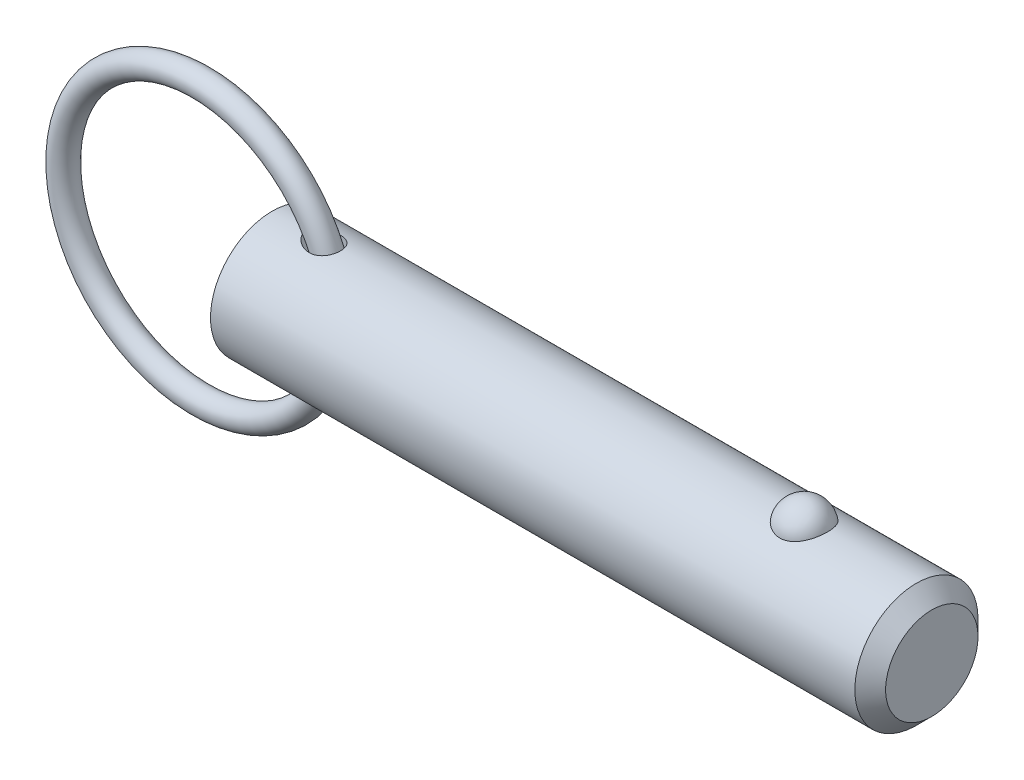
ISO-10303-21;
HEADER;
FILE_DESCRIPTION(('STEP AP214'),'2;1');
FILE_NAME('part.step','',(''),(''),'','','');
FILE_SCHEMA(('AUTOMOTIVE_DESIGN { 1 0 10303 214 1 1 1 1 }'));
ENDSEC;
DATA;
#1=APPLICATION_CONTEXT('core data for automotive mechanical design processes');
#2=APPLICATION_PROTOCOL_DEFINITION('international standard','automotive_design',2000,#1);
#3=PRODUCT_CONTEXT('',#1,'mechanical');
#4=PRODUCT('Part','Part','',(#3));
#5=PRODUCT_RELATED_PRODUCT_CATEGORY('part','',(#4));
#6=PRODUCT_DEFINITION_FORMATION('','',#4);
#7=PRODUCT_DEFINITION_CONTEXT('part definition',#1,'design');
#8=PRODUCT_DEFINITION('design','',#6,#7);
#9=PRODUCT_DEFINITION_SHAPE('','',#8);
#10=(LENGTH_UNIT() NAMED_UNIT(*) SI_UNIT(.MILLI.,.METRE.));
#11=(NAMED_UNIT(*) PLANE_ANGLE_UNIT() SI_UNIT($,.RADIAN.));
#12=(NAMED_UNIT(*) SI_UNIT($,.STERADIAN.) SOLID_ANGLE_UNIT());
#13=UNCERTAINTY_MEASURE_WITH_UNIT(LENGTH_MEASURE(1.E-05),#10,'distance_accuracy_value','');
#14=(GEOMETRIC_REPRESENTATION_CONTEXT(3) GLOBAL_UNCERTAINTY_ASSIGNED_CONTEXT((#13)) GLOBAL_UNIT_ASSIGNED_CONTEXT((#10,
#11,#12)) REPRESENTATION_CONTEXT('',''));
#15=CARTESIAN_POINT('',(0.,0.,0.));
#16=DIRECTION('',(0.,0.,1.));
#17=DIRECTION('',(1.,0.,0.));
#18=AXIS2_PLACEMENT_3D('',#15,#16,#17);
#19=CARTESIAN_POINT('',(-8.23730968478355,0.,0.));
#20=DIRECTION('',(0.,0.,1.));
#21=DIRECTION('',(1.,0.,0.));
#22=AXIS2_PLACEMENT_3D('',#19,#20,#21);
#23=TOROIDAL_SURFACE('',#22,15.875,1.422);
#24=CARTESIAN_POINT('',(9.05969031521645,0.,0.));
#25=VERTEX_POINT('',#24);
#26=VERTEX_LOOP('',#25);
#27=FACE_BOUND('',#26,.T.);
#28=ADVANCED_FACE('P0_F12',(#27),#23,.T.);
#29=CLOSED_SHELL('',(#28));
#30=MANIFOLD_SOLID_BREP('P0_B1',#29);
#31=CARTESIAN_POINT('',(0.,0.,0.));
#32=DIRECTION('',(1.,0.,0.));
#33=DIRECTION('',(0.,0.,-1.));
#34=AXIS2_PLACEMENT_3D('',#31,#32,#33);
#35=CYLINDRICAL_SURFACE('',#34,7.11);
#36=CARTESIAN_POINT('',(3.98467340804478,7.10072679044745,-0.363013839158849));
#37=CARTESIAN_POINT('',(4.00971652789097,7.09600153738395,-0.45539194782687));
#38=CARTESIAN_POINT('',(4.04401947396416,7.08958406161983,-0.545230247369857));
#39=CARTESIAN_POINT('',(4.12810160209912,7.07427055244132,-0.717157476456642));
#40=CARTESIAN_POINT('',(4.17791765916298,7.06536861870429,-0.799227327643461));
#41=CARTESIAN_POINT('',(4.28924471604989,7.04620300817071,-0.953469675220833));
#42=CARTESIAN_POINT('',(4.35063580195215,7.035953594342,-1.02573162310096));
#43=CARTESIAN_POINT('',(4.48282610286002,7.01493313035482,-1.16081412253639));
#44=CARTESIAN_POINT('',(4.55362244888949,7.00416223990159,-1.22363754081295));
#45=CARTESIAN_POINT('',(4.71659336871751,6.98090398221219,-1.35055080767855));
#46=CARTESIAN_POINT('',(4.81029272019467,6.96847103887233,-1.41269256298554));
#47=CARTESIAN_POINT('',(5.0057240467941,6.94515366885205,-1.52319699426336));
#48=CARTESIAN_POINT('',(5.10746392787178,6.93427079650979,-1.57154588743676));
#49=CARTESIAN_POINT('',(5.33503739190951,6.91346066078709,-1.66091325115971));
#50=CARTESIAN_POINT('',(5.46199550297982,6.90402388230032,-1.69921932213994));
#51=CARTESIAN_POINT('',(5.72084799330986,6.89024030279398,-1.75428261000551));
#52=CARTESIAN_POINT('',(5.85274301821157,6.88589416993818,-1.77103699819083));
#53=CARTESIAN_POINT('',(6.11557710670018,6.88337277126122,-1.78081990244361));
#54=CARTESIAN_POINT('',(6.24650031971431,6.88510489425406,-1.77420448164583));
#55=CARTESIAN_POINT('',(6.50446311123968,6.89478744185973,-1.73620392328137));
#56=CARTESIAN_POINT('',(6.6315075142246,6.90272978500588,-1.70485097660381));
#57=CARTESIAN_POINT('',(6.85933269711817,6.92243075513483,-1.62281888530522));
#58=CARTESIAN_POINT('',(6.96133251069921,6.93352131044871,-1.5753580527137));
#59=CARTESIAN_POINT('',(7.15436649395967,6.95824811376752,-1.46226310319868));
#60=CARTESIAN_POINT('',(7.24540699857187,6.97188287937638,-1.3966395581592));
#61=CARTESIAN_POINT('',(7.40446019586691,6.99838217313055,-1.25668991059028));
#62=CARTESIAN_POINT('',(7.473875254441,7.01118308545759,-1.18393777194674));
#63=CARTESIAN_POINT('',(7.59904891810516,7.03582803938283,-1.02736918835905));
#64=CARTESIAN_POINT('',(7.65481029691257,7.04767227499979,-0.943554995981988));
#65=CARTESIAN_POINT('',(7.74982438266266,7.06873077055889,-0.76979592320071));
#66=CARTESIAN_POINT('',(7.7894903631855,7.07800861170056,-0.680084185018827));
#67=CARTESIAN_POINT('',(7.85354088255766,7.09334756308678,-0.495102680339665));
#68=CARTESIAN_POINT('',(7.87792559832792,7.09940871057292,-0.399832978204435));
#69=CARTESIAN_POINT('',(7.9108898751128,7.10766731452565,-0.206294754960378));
#70=CARTESIAN_POINT('',(7.91944662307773,7.10985919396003,-0.108022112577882));
#71=CARTESIAN_POINT('',(7.920501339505,7.11012756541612,0.0886168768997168));
#72=CARTESIAN_POINT('',(7.91299895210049,7.10820396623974,0.186983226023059));
#73=CARTESIAN_POINT('',(7.88205794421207,7.10043733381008,0.381270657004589));
#74=CARTESIAN_POINT('',(7.85857985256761,7.09458459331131,0.477185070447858));
#75=CARTESIAN_POINT('',(7.79617406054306,7.07958431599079,0.663575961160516));
#76=CARTESIAN_POINT('',(7.75724672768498,7.07043685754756,0.754052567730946));
#77=CARTESIAN_POINT('',(7.66496731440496,7.04987259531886,0.926798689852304));
#78=CARTESIAN_POINT('',(7.61164530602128,7.0384605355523,1.00908483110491));
#79=CARTESIAN_POINT('',(7.49191707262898,7.01461776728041,1.16333092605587));
#80=CARTESIAN_POINT('',(7.42551210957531,7.00218715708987,1.235291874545));
#81=CARTESIAN_POINT('',(7.28164031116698,6.97770944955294,1.36680167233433));
#82=CARTESIAN_POINT('',(7.20420170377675,6.96566146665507,1.42638126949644));
#83=CARTESIAN_POINT('',(7.0403906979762,6.94319963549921,1.53199377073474));
#84=CARTESIAN_POINT('',(6.95401827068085,6.93278579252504,1.57802663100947));
#85=CARTESIAN_POINT('',(6.7731858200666,6.91444459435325,1.65656940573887));
#86=CARTESIAN_POINT('',(6.67860569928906,6.90656682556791,1.68881327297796));
#87=CARTESIAN_POINT('',(6.48544119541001,6.89422806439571,1.73849768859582));
#88=CARTESIAN_POINT('',(6.38685561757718,6.88976809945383,1.755933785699));
#89=CARTESIAN_POINT('',(6.18089829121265,6.88429907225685,1.77726234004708));
#90=CARTESIAN_POINT('',(6.07340937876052,6.88356485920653,1.78007646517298));
#91=CARTESIAN_POINT('',(5.85921220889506,6.886086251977,1.77029087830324));
#92=CARTESIAN_POINT('',(5.75250426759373,6.88934339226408,1.75768523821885));
#93=CARTESIAN_POINT('',(5.52848027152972,6.89994454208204,1.71563399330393));
#94=CARTESIAN_POINT('',(5.41155168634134,6.90775772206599,1.68424184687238));
#95=CARTESIAN_POINT('',(5.18376466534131,6.92670168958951,1.60454711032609));
#96=CARTESIAN_POINT('',(5.07291446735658,6.9378368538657,1.5562221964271));
#97=CARTESIAN_POINT('',(4.84835244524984,6.96347168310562,1.43744827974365));
#98=CARTESIAN_POINT('',(4.73562531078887,6.97820486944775,1.36517310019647));
#99=CARTESIAN_POINT('',(4.52504912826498,7.00822340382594,1.20158053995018));
#100=CARTESIAN_POINT('',(4.42717478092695,7.02350775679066,1.11029618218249));
#101=CARTESIAN_POINT('',(4.27935716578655,7.04784659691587,0.940654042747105));
#102=CARTESIAN_POINT('',(4.2239722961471,7.05736064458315,0.867099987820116));
#103=CARTESIAN_POINT('',(4.12558347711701,7.07469854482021,0.711919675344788));
#104=CARTESIAN_POINT('',(4.08256922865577,7.0825238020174,0.630300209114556));
#105=CARTESIAN_POINT('',(4.01142860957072,7.09565978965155,0.459428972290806));
#106=CARTESIAN_POINT('',(3.98346043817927,7.10094374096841,0.370107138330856));
#107=CARTESIAN_POINT('',(3.95517285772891,7.1063173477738,0.233358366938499));
#108=CARTESIAN_POINT('',(3.94802115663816,7.1076831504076,0.187321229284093));
#109=CARTESIAN_POINT('',(3.93842121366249,7.10951900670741,0.0947476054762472));
#110=CARTESIAN_POINT('',(3.93597129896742,7.10998937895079,0.0482113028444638));
#111=CARTESIAN_POINT('',(3.93584361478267,7.11001358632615,-0.0598597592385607));
#112=CARTESIAN_POINT('',(3.9399538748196,7.10922402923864,-0.121405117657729));
#113=CARTESIAN_POINT('',(3.95632793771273,7.10609781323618,-0.243320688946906));
#114=CARTESIAN_POINT('',(3.96859135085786,7.10376122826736,-0.303690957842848));
#115=CARTESIAN_POINT('',(3.98467340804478,7.10072679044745,-0.363013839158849));
#116=B_SPLINE_CURVE_WITH_KNOTS('',3,(#36,#37,#38,#39,#40,#41,#42,#43,#44,#45,#46,#47,#48,#49,
#50,#51,#52,#53,#54,#55,#56,#57,#58,#59,#60,#61,#62,#63,#64,#65,#66,#67,#68,#69,#70,#71,#72,#73,
#74,#75,#76,#77,#78,#79,#80,#81,#82,#83,#84,#85,#86,#87,#88,#89,#90,#91,#92,#93,#94,#95,#96,#97,
#98,#99,#100,#101,#102,#103,#104,#105,#106,#107,#108,#109,#110,#111,#112,#113,#114,#115),
.UNSPECIFIED.,.T.,.F.,(4,2,2,2,2,2,2,2,2,2,2,2,2,2,2,2,2,2,2,2,2,2,2,2,2,2,2,2,2,2,2,2,2,2,2,2,
2,2,2,4),(0.,0.287206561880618,0.575101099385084,0.860162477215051,1.14513709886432,
1.48324846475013,1.82169652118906,2.21865672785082,2.6156690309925,3.00665870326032,
3.39714041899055,3.73437585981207,4.07141541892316,4.37402271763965,4.67656849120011,
4.97076150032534,5.26495110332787,5.55956439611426,5.85418421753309,6.14953461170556,
6.44487798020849,6.73960905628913,7.03431171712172,7.32827352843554,7.6222362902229,
7.9216396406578,8.22113296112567,8.54242840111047,8.86384740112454,9.22635035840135,
9.58933304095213,9.99153142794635,10.3930368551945,10.6697219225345,10.9461759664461,
11.2254825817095,11.3650959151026,11.5046595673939,11.6891051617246,11.8735419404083),.UNSPECIFIED.);
#117=CARTESIAN_POINT('',(3.98467340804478,7.10072679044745,-0.363013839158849));
#118=VERTEX_POINT('',#117);
#119=EDGE_CURVE('P1_E40',#118,#118,#116,.T.);
#120=ORIENTED_EDGE('',*,*,#119,.T.);
#121=EDGE_LOOP('',(#120));
#122=FACE_BOUND('',#121,.T.);
#123=CARTESIAN_POINT('',(74.3925,0.,0.));
#124=DIRECTION('',(1.,0.,0.));
#125=DIRECTION('',(0.,0.,-1.));
#126=AXIS2_PLACEMENT_3D('',#123,#124,#125);
#127=CIRCLE('',#126,7.11);
#128=CARTESIAN_POINT('',(74.3925,0.,-7.11));
#129=VERTEX_POINT('',#128);
#130=EDGE_CURVE('P1_E25',#129,#129,#127,.T.);
#131=ORIENTED_EDGE('',*,*,#130,.F.);
#132=EDGE_LOOP('',(#131));
#133=FACE_BOUND('',#132,.T.);
#134=CARTESIAN_POINT('',(0.,0.,0.));
#135=DIRECTION('',(1.,0.,0.));
#136=DIRECTION('',(0.,0.,-1.));
#137=AXIS2_PLACEMENT_3D('',#134,#135,#136);
#138=CIRCLE('',#137,7.11);
#139=CARTESIAN_POINT('',(0.,0.,-7.11));
#140=VERTEX_POINT('',#139);
#141=EDGE_CURVE('P1_E9',#140,#140,#138,.T.);
#142=ORIENTED_EDGE('',*,*,#141,.T.);
#143=EDGE_LOOP('',(#142));
#144=FACE_BOUND('',#143,.T.);
#145=CARTESIAN_POINT('',(61.429258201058,6.53646663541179,2.7976246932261));
#146=CARTESIAN_POINT('',(61.2844296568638,6.53647876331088,2.79761243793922));
#147=CARTESIAN_POINT('',(61.139368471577,6.54144531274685,2.78608115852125));
#148=CARTESIAN_POINT('',(60.8532920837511,6.56077791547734,2.74023282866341));
#149=CARTESIAN_POINT('',(60.7122884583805,6.5751685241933,2.70585624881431));
#150=CARTESIAN_POINT('',(60.4388833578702,6.61165072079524,2.61544042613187));
#151=CARTESIAN_POINT('',(60.3064602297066,6.63372195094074,2.55945840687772));
#152=CARTESIAN_POINT('',(60.0532337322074,6.68316012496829,2.42742958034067));
#153=CARTESIAN_POINT('',(59.9324254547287,6.71052481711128,2.35139129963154));
#154=CARTESIAN_POINT('',(59.7016372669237,6.76860821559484,2.17866150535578));
#155=CARTESIAN_POINT('',(59.5920857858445,6.79940242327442,2.08142342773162));
#156=CARTESIAN_POINT('',(59.3903340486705,6.86050242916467,1.87020907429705));
#157=CARTESIAN_POINT('',(59.2981390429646,6.89080807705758,1.75622775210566));
#158=CARTESIAN_POINT('',(59.1292547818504,6.94923069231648,1.50900646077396));
#159=CARTESIAN_POINT('',(59.0534289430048,6.97719213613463,1.37513873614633));
#160=CARTESIAN_POINT('',(58.9242063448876,7.02647251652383,1.09584817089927));
#161=CARTESIAN_POINT('',(58.8708109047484,7.04779106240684,0.950424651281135));
#162=CARTESIAN_POINT('',(58.7871019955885,7.08180248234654,0.650508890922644));
#163=CARTESIAN_POINT('',(58.7570253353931,7.09440672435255,0.495940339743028));
#164=CARTESIAN_POINT('',(58.7214735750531,7.10935121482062,0.183515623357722));
#165=CARTESIAN_POINT('',(58.7159974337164,7.11169189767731,0.0256595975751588));
#166=CARTESIAN_POINT('',(58.729700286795,7.10589702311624,-0.287512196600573));
#167=CARTESIAN_POINT('',(58.7486823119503,7.0978451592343,-0.442838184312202));
#168=CARTESIAN_POINT('',(58.8105745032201,7.07221860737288,-0.7478308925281));
#169=CARTESIAN_POINT('',(58.8534850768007,7.05464375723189,-0.897497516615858));
#170=CARTESIAN_POINT('',(58.9624527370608,7.01171031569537,-1.18722864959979));
#171=CARTESIAN_POINT('',(59.0285458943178,6.98633960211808,-1.32727778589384));
#172=CARTESIAN_POINT('',(59.1825362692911,6.93042258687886,-1.59370324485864));
#173=CARTESIAN_POINT('',(59.2704355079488,6.89987580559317,-1.7200782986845));
#174=CARTESIAN_POINT('',(59.4669269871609,6.83659510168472,-1.95657345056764));
#175=CARTESIAN_POINT('',(59.5756640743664,6.80384697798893,-2.06656957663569));
#176=CARTESIAN_POINT('',(59.8109686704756,6.7400183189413,-2.26611005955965));
#177=CARTESIAN_POINT('',(59.9375350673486,6.70893767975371,-2.35565569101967));
#178=CARTESIAN_POINT('',(60.2028454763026,6.65264442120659,-2.51019726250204));
#179=CARTESIAN_POINT('',(60.3413230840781,6.62733449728,-2.57561395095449));
#180=CARTESIAN_POINT('',(60.6285194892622,6.58495995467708,-2.68211134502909));
#181=CARTESIAN_POINT('',(60.7772343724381,6.56789220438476,-2.72320129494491));
#182=CARTESIAN_POINT('',(61.0726268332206,6.54478663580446,-2.7782581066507));
#183=CARTESIAN_POINT('',(61.2190295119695,6.53823639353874,-2.79348727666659));
#184=CARTESIAN_POINT('',(61.5124700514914,6.53532718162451,-2.80028921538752));
#185=CARTESIAN_POINT('',(61.6595077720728,6.53896606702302,-2.79186696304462));
#186=CARTESIAN_POINT('',(61.9449210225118,6.55570357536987,-2.7523217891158));
#187=CARTESIAN_POINT('',(62.0834221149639,6.56848455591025,-2.72196077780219));
#188=CARTESIAN_POINT('',(62.3531142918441,6.60173528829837,-2.64028774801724));
#189=CARTESIAN_POINT('',(62.484304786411,6.62220565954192,-2.58897404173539));
#190=CARTESIAN_POINT('',(62.7388462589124,6.6691792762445,-2.46547820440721));
#191=CARTESIAN_POINT('',(62.8619691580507,6.69580233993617,-2.39287266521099));
#192=CARTESIAN_POINT('',(63.0944418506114,6.75207041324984,-2.22915269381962));
#193=CARTESIAN_POINT('',(63.2037884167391,6.78171612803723,-2.1380339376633));
#194=CARTESIAN_POINT('',(63.411642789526,6.84264629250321,-1.93445592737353));
#195=CARTESIAN_POINT('',(63.5093178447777,6.87393748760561,-1.82114774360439));
#196=CARTESIAN_POINT('',(63.6850112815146,6.93345710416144,-1.57947787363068));
#197=CARTESIAN_POINT('',(63.7630261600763,6.96168497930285,-1.45111351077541));
#198=CARTESIAN_POINT('',(63.8999857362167,7.01307558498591,-1.17842708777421));
#199=CARTESIAN_POINT('',(63.9582588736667,7.03605262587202,-1.03373189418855));
#200=CARTESIAN_POINT('',(64.0510815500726,7.07340932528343,-0.735867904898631));
#201=CARTESIAN_POINT('',(64.0856311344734,7.08778900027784,-0.582699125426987));
#202=CARTESIAN_POINT('',(64.1302742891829,7.10647639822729,-0.27242066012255));
#203=CARTESIAN_POINT('',(64.14039710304,7.11079616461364,-0.115315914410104));
#204=CARTESIAN_POINT('',(64.136061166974,7.10896059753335,0.198488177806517));
#205=CARTESIAN_POINT('',(64.1216031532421,7.10280557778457,0.355187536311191));
#206=CARTESIAN_POINT('',(64.0685727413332,7.08071500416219,0.662724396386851));
#207=CARTESIAN_POINT('',(64.0301505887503,7.06484039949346,0.813592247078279));
#208=CARTESIAN_POINT('',(63.930101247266,7.0249589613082,1.10629159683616));
#209=CARTESIAN_POINT('',(63.8684724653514,7.00095156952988,1.24812247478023));
#210=CARTESIAN_POINT('',(63.7227668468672,6.94706632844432,1.51976439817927));
#211=CARTESIAN_POINT('',(63.6385448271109,6.91715085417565,1.64949012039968));
#212=CARTESIAN_POINT('',(63.4495861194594,6.8547056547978,1.89231285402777));
#213=CARTESIAN_POINT('',(63.3448501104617,6.82217601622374,2.00541041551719));
#214=CARTESIAN_POINT('',(63.1171030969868,6.75805358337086,2.21190674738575));
#215=CARTESIAN_POINT('',(62.994082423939,6.72646129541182,2.30529503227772));
#216=CARTESIAN_POINT('',(62.7327347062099,6.66789520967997,2.46959908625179));
#217=CARTESIAN_POINT('',(62.5944019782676,6.64092313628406,2.54050647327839));
#218=CARTESIAN_POINT('',(62.3111828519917,6.5957258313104,2.65560045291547));
#219=CARTESIAN_POINT('',(62.1666660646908,6.57724013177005,2.70059539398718));
#220=CARTESIAN_POINT('',(61.8715469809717,6.55006426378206,2.76587321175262));
#221=CARTESIAN_POINT('',(61.7209640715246,6.54134511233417,2.78622922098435));
#222=CARTESIAN_POINT('',(61.5230463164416,6.53697847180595,2.79642434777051));
#223=CARTESIAN_POINT('',(61.4761644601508,6.53646270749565,2.7976286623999));
#224=CARTESIAN_POINT('',(61.429258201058,6.53646663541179,2.7976246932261));
#225=B_SPLINE_CURVE_WITH_KNOTS('',3,(#145,#146,#147,#148,#149,#150,#151,#152,#153,#154,#155,
#156,#157,#158,#159,#160,#161,#162,#163,#164,#165,#166,#167,#168,#169,#170,#171,#172,#173,#174,
#175,#176,#177,#178,#179,#180,#181,#182,#183,#184,#185,#186,#187,#188,#189,#190,#191,#192,#193,
#194,#195,#196,#197,#198,#199,#200,#201,#202,#203,#204,#205,#206,#207,#208,#209,#210,#211,#212,
#213,#214,#215,#216,#217,#218,#219,#220,#221,#222,#223,#224),.UNSPECIFIED.,.T.,.F.,(4,2,2,2,2,2,
2,2,2,2,2,2,2,2,2,2,2,2,2,2,2,2,2,2,2,2,2,2,2,2,2,2,2,2,2,2,2,2,2,4),(0.,0.434355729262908,
0.869847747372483,1.30419416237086,1.73835621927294,2.18541922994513,2.63261726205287,
3.09954261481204,3.5664954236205,4.03813031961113,4.50974525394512,4.97758575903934,
5.44543423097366,5.91401389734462,6.3826370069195,6.85464418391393,7.32662193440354,
7.7899297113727,8.25306131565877,8.69285754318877,9.13256119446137,9.55768625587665,
9.98284556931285,10.4171106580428,10.8514772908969,11.3079089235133,11.7644218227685,
12.2351898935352,12.7059570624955,13.1761603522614,13.6463495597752,14.1136200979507,
14.580922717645,15.0513032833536,15.5216682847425,15.9922828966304,16.4630727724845,
16.918245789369,17.372064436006,17.5127411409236),.UNSPECIFIED.);
#226=CARTESIAN_POINT('',(61.429258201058,6.53646663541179,2.7976246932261));
#227=VERTEX_POINT('',#226);
#228=EDGE_CURVE('P1_E34',#227,#227,#225,.T.);
#229=ORIENTED_EDGE('',*,*,#228,.T.);
#230=EDGE_LOOP('',(#229));
#231=FACE_BOUND('',#230,.T.);
#232=CARTESIAN_POINT('',(3.98467340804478,-7.10072679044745,-0.363013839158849));
#233=CARTESIAN_POINT('',(3.96426456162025,-7.10457733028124,-0.287714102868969));
#234=CARTESIAN_POINT('',(3.95000501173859,-7.10730349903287,-0.210695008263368));
#235=CARTESIAN_POINT('',(3.93481801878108,-7.11020840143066,-0.0553038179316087));
#236=CARTESIAN_POINT('',(3.93388435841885,-7.11038832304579,0.0230676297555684));
#237=CARTESIAN_POINT('',(3.94541910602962,-7.10817995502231,0.178714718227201));
#238=CARTESIAN_POINT('',(3.95787987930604,-7.10579312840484,0.25599095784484));
#239=CARTESIAN_POINT('',(3.99523775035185,-7.09872642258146,0.407352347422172));
#240=CARTESIAN_POINT('',(4.02014065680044,-7.09404547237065,0.481435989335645));
#241=CARTESIAN_POINT('',(4.08119600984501,-7.08278363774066,0.625775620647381));
#242=CARTESIAN_POINT('',(4.11749458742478,-7.07617815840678,0.695967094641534));
#243=CARTESIAN_POINT('',(4.19940836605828,-7.06165305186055,0.830508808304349));
#244=CARTESIAN_POINT('',(4.24502952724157,-7.0537325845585,0.894855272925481));
#245=CARTESIAN_POINT('',(4.36790232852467,-7.03310314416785,1.04688574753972));
#246=CARTESIAN_POINT('',(4.44977459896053,-7.01993229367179,1.13078695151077));
#247=CARTESIAN_POINT('',(4.62610796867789,-6.99351259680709,1.28411726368));
#248=CARTESIAN_POINT('',(4.7205898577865,-6.98026365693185,1.35352197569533));
#249=CARTESIAN_POINT('',(4.92036507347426,-6.9549104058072,1.47831921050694));
#250=CARTESIAN_POINT('',(5.02579054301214,-6.94282458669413,1.53350332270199));
#251=CARTESIAN_POINT('',(5.24378330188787,-6.92129098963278,1.62793610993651));
#252=CARTESIAN_POINT('',(5.35635066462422,-6.91184323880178,1.66718462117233));
#253=CARTESIAN_POINT('',(5.60134354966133,-6.89573491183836,1.73269893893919));
#254=CARTESIAN_POINT('',(5.73444697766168,-6.8895970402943,1.75661057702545));
#255=CARTESIAN_POINT('',(6.00300738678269,-6.88344616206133,1.78057487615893));
#256=CARTESIAN_POINT('',(6.13846360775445,-6.88343121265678,1.78063510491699));
#257=CARTESIAN_POINT('',(6.39660470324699,-6.88981379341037,1.75576480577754));
#258=CARTESIAN_POINT('',(6.51947843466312,-6.89572457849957,1.73273121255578));
#259=CARTESIAN_POINT('',(6.75813770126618,-6.91274434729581,1.66352936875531));
#260=CARTESIAN_POINT('',(6.87393155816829,-6.92384709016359,1.61738888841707));
#261=CARTESIAN_POINT('',(7.07801861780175,-6.94787316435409,1.51052664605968));
#262=CARTESIAN_POINT('',(7.16789841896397,-6.96033024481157,1.45271574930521));
#263=CARTESIAN_POINT('',(7.33546773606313,-6.98638661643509,1.32171912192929));
#264=CARTESIAN_POINT('',(7.41316182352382,-6.99998547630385,1.24853918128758));
#265=CARTESIAN_POINT('',(7.54861420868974,-7.02559503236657,1.09486170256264));
#266=CARTESIAN_POINT('',(7.60741145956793,-7.03764930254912,1.01528346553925));
#267=CARTESIAN_POINT('',(7.71070740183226,-7.0598657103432,0.847099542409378));
#268=CARTESIAN_POINT('',(7.75520788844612,-7.0700280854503,0.758494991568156));
#269=CARTESIAN_POINT('',(7.82836147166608,-7.08722075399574,0.575936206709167));
#270=CARTESIAN_POINT('',(7.85719783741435,-7.09428707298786,0.482058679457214));
#271=CARTESIAN_POINT('',(7.89918378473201,-7.10470260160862,0.29065874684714));
#272=CARTESIAN_POINT('',(7.91233308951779,-7.10805174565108,0.193136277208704));
#273=CARTESIAN_POINT('',(7.92267451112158,-7.11067890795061,-0.00313968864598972));
#274=CARTESIAN_POINT('',(7.91981203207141,-7.10994299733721,-0.10189624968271));
#275=CARTESIAN_POINT('',(7.89806489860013,-7.10444651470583,-0.297516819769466));
#276=CARTESIAN_POINT('',(7.87918005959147,-7.09968589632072,-0.394380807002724));
#277=CARTESIAN_POINT('',(7.82577988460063,-7.0866471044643,-0.58355375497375));
#278=CARTESIAN_POINT('',(7.79124976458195,-7.07836560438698,-0.675858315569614));
#279=CARTESIAN_POINT('',(7.70736343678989,-7.05919003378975,-0.853167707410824));
#280=CARTESIAN_POINT('',(7.65800801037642,-7.04829610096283,-0.938172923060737));
#281=CARTESIAN_POINT('',(7.54590141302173,-7.02513961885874,-1.09819812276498));
#282=CARTESIAN_POINT('',(7.48319521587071,-7.01288172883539,-1.17325029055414));
#283=CARTESIAN_POINT('',(7.34599775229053,-6.98832192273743,-1.31164333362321));
#284=CARTESIAN_POINT('',(7.27150757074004,-6.97602001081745,-1.37498528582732));
#285=CARTESIAN_POINT('',(7.11277776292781,-6.95268608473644,-1.48849974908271));
#286=CARTESIAN_POINT('',(7.02852525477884,-6.94165578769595,-1.53865456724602));
#287=CARTESIAN_POINT('',(6.85282430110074,-6.92200320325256,-1.62478650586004));
#288=CARTESIAN_POINT('',(6.76137511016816,-6.91338116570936,-1.66076215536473));
#289=CARTESIAN_POINT('',(6.57061179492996,-6.89906044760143,-1.71930563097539));
#290=CARTESIAN_POINT('',(6.47113516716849,-6.89347290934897,-1.74136795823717));
#291=CARTESIAN_POINT('',(6.26989833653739,-6.88605020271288,-1.7704895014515));
#292=CARTESIAN_POINT('',(6.16813737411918,-6.88421630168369,-1.77754365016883));
#293=CARTESIAN_POINT('',(5.95492537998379,-6.88424071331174,-1.77745174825));
#294=CARTESIAN_POINT('',(5.8434768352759,-6.88646827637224,-1.76888555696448));
#295=CARTESIAN_POINT('',(5.62307560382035,-6.89483827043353,-1.73596677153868));
#296=CARTESIAN_POINT('',(5.51412477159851,-6.90098351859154,-1.71160281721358));
#297=CARTESIAN_POINT('',(5.28644478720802,-6.91743803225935,-1.64393691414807));
#298=CARTESIAN_POINT('',(5.16837217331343,-6.92819628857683,-1.59852806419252));
#299=CARTESIAN_POINT('',(4.94091825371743,-6.95234836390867,-1.4899796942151));
#300=CARTESIAN_POINT('',(4.83153887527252,-6.96574276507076,-1.42683625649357));
#301=CARTESIAN_POINT('',(4.63576710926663,-6.99209234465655,-1.29112257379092));
#302=CARTESIAN_POINT('',(4.54816728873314,-7.00494184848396,-1.22027748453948));
#303=CARTESIAN_POINT('',(4.38554897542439,-7.03019055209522,-1.0652111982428));
#304=CARTESIAN_POINT('',(4.31052141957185,-7.04259007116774,-0.980999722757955));
#305=CARTESIAN_POINT('',(4.18551811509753,-7.0640229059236,-0.811206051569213));
#306=CARTESIAN_POINT('',(4.13358417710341,-7.07328321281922,-0.727107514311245));
#307=CARTESIAN_POINT('',(4.04607461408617,-7.0891994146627,-0.550580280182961));
#308=CARTESIAN_POINT('',(4.01046401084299,-7.09586087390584,-0.458169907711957));
#309=CARTESIAN_POINT('',(3.98467340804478,-7.10072679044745,-0.363013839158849));
#310=B_SPLINE_CURVE_WITH_KNOTS('',3,(#232,#233,#234,#235,#236,#237,#238,#239,#240,#241,#242,
#243,#244,#245,#246,#247,#248,#249,#250,#251,#252,#253,#254,#255,#256,#257,#258,#259,#260,#261,
#262,#263,#264,#265,#266,#267,#268,#269,#270,#271,#272,#273,#274,#275,#276,#277,#278,#279,#280,
#281,#282,#283,#284,#285,#286,#287,#288,#289,#290,#291,#292,#293,#294,#295,#296,#297,#298,#299,
#300,#301,#302,#303,#304,#305,#306,#307,#308,#309),.UNSPECIFIED.,.T.,.F.,(4,2,2,2,2,2,2,2,2,2,2,
2,2,2,2,2,2,2,2,2,2,2,2,2,2,2,2,2,2,2,2,2,2,2,2,2,2,2,4),(0.,0.23402065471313,0.467932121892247,
0.701710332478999,0.935597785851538,1.17261620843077,1.40978663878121,1.76177576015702,
2.11435255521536,2.47183528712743,2.8293216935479,3.23332937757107,3.63720887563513,
4.01042610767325,4.38319587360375,4.70425151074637,5.02518641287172,5.32277979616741,
5.62033579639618,5.91433101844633,6.2083314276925,6.50333490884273,6.79834178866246,
7.09362801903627,7.38889868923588,7.6831900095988,7.9774542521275,8.27211131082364,
8.56679892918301,8.8716552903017,9.17661456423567,9.51069129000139,9.84500851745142,
10.2243046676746,10.6036846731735,10.9425776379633,11.2812252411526,11.5775945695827,
11.8733258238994),.UNSPECIFIED.);
#311=CARTESIAN_POINT('',(3.98467340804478,-7.10072679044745,-0.363013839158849));
#312=VERTEX_POINT('',#311);
#313=EDGE_CURVE('P1_E17',#312,#312,#310,.T.);
#314=ORIENTED_EDGE('',*,*,#313,.T.);
#315=EDGE_LOOP('',(#314));
#316=FACE_BOUND('',#315,.T.);
#317=ADVANCED_FACE('P1_F13',(#122,#133,#144,#231,#316),#35,.T.);
#318=CARTESIAN_POINT('',(0.,0.,0.));
#319=DIRECTION('',(-1.,0.,0.));
#320=DIRECTION('',(0.,0.,1.));
#321=AXIS2_PLACEMENT_3D('',#318,#319,#320);
#322=PLANE('',#321);
#323=ORIENTED_EDGE('',*,*,#141,.F.);
#324=EDGE_LOOP('',(#323));
#325=FACE_BOUND('',#324,.T.);
#326=ADVANCED_FACE('P1_F15',(#325),#322,.T.);
#327=CARTESIAN_POINT('',(76.17,0.,0.));
#328=DIRECTION('',(-1.,0.,0.));
#329=DIRECTION('',(0.,0.,1.));
#330=AXIS2_PLACEMENT_3D('',#327,#328,#329);
#331=CONICAL_SURFACE('',#330,5.33250000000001,0.785398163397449);
#332=ORIENTED_EDGE('',*,*,#130,.T.);
#333=EDGE_LOOP('',(#332));
#334=FACE_BOUND('',#333,.T.);
#335=CARTESIAN_POINT('',(76.17,0.,0.));
#336=DIRECTION('',(1.,0.,0.));
#337=DIRECTION('',(0.,0.,-1.));
#338=AXIS2_PLACEMENT_3D('',#335,#336,#337);
#339=CIRCLE('',#338,5.33250000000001);
#340=CARTESIAN_POINT('',(76.17,0.,-5.33250000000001));
#341=VERTEX_POINT('',#340);
#342=EDGE_CURVE('P1_E30',#341,#341,#339,.T.);
#343=ORIENTED_EDGE('',*,*,#342,.F.);
#344=EDGE_LOOP('',(#343));
#345=FACE_BOUND('',#344,.T.);
#346=ADVANCED_FACE('P1_F55',(#334,#345),#331,.T.);
#347=CARTESIAN_POINT('',(76.17,5.33250000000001,0.));
#348=DIRECTION('',(1.,0.,0.));
#349=DIRECTION('',(0.,0.,-1.));
#350=AXIS2_PLACEMENT_3D('',#347,#348,#349);
#351=PLANE('',#350);
#352=ORIENTED_EDGE('',*,*,#342,.T.);
#353=EDGE_LOOP('',(#352));
#354=FACE_BOUND('',#353,.T.);
#355=ADVANCED_FACE('P1_F51',(#354),#351,.T.);
#356=CARTESIAN_POINT('',(61.429258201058,6.399,0.));
#357=DIRECTION('',(-1.,0.,0.));
#358=DIRECTION('',(0.,1.,0.));
#359=AXIS2_PLACEMENT_3D('',#356,#357,#358);
#360=SPHERICAL_SURFACE('',#359,2.80099999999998);
#361=ORIENTED_EDGE('',*,*,#228,.F.);
#362=EDGE_LOOP('',(#361));
#363=FACE_BOUND('',#362,.T.);
#364=ADVANCED_FACE('P1_F46',(#363),#360,.T.);
#365=CARTESIAN_POINT('',(-8.23730968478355,0.,0.));
#366=DIRECTION('',(0.,0.,1.));
#367=DIRECTION('',(1.,0.,0.));
#368=AXIS2_PLACEMENT_3D('',#365,#366,#367);
#369=TOROIDAL_SURFACE('',#368,15.875,1.7775);
#370=ORIENTED_EDGE('',*,*,#313,.F.);
#371=EDGE_LOOP('',(#370));
#372=FACE_BOUND('',#371,.T.);
#373=ORIENTED_EDGE('',*,*,#119,.F.);
#374=EDGE_LOOP('',(#373));
#375=FACE_BOUND('',#374,.T.);
#376=ADVANCED_FACE('P1_F50',(#372,#375),#369,.F.);
#377=CLOSED_SHELL('',(#317,#326,#346,#355,#364,#376));
#378=MANIFOLD_SOLID_BREP('P1_B1',#377);
#379=ADVANCED_BREP_SHAPE_REPRESENTATION('',(#18,#30,#378),#14);
#380=SHAPE_DEFINITION_REPRESENTATION(#9,#379);
ENDSEC;
END-ISO-10303-21;
